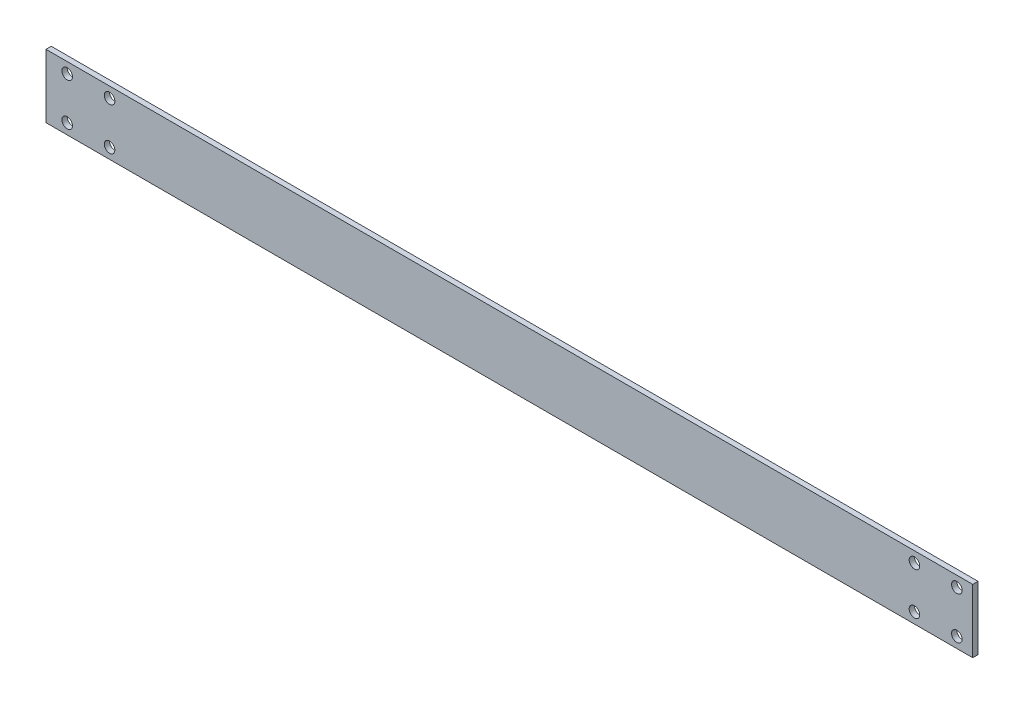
from build123d import *

# Parameters (mm, degrees)
SKETCH_1_W      = 350
SKETCH_1_H      = 24
SKETCH_1_R      = 2
EXTRUDE_2_DEPTH = 2


with BuildPart() as part:
    # Sketch 1 → Extrude 2 (new body)
    with BuildSketch(Plane.XY):
        with Locations((175, 12)):
            Rectangle(SKETCH_1_W, SKETCH_1_H)
        with Locations((8, 20)):
            Circle(SKETCH_1_R, mode=Mode.SUBTRACT)
        with Locations((24, 20)):
            Circle(SKETCH_1_R, mode=Mode.SUBTRACT)
        with Locations((24, 4)):
            Circle(SKETCH_1_R, mode=Mode.SUBTRACT)
        with Locations((8, 4)):
            Circle(SKETCH_1_R, mode=Mode.SUBTRACT)
        with Locations(Location((344, 4, 0), (0, 0, 180))):
            Circle(SKETCH_1_R, mode=Mode.SUBTRACT)
        with Locations(Location((328, 4, 0), (0, 0, 180))):
            Circle(SKETCH_1_R, mode=Mode.SUBTRACT)
        with Locations(Location((328, 20, 0), (0, 0, 180))):
            Circle(SKETCH_1_R, mode=Mode.SUBTRACT)
        with Locations(Location((344, 20, 0), (0, 0, 180))):
            Circle(SKETCH_1_R, mode=Mode.SUBTRACT)
    extrude(amount=EXTRUDE_2_DEPTH)


solid = part.part
